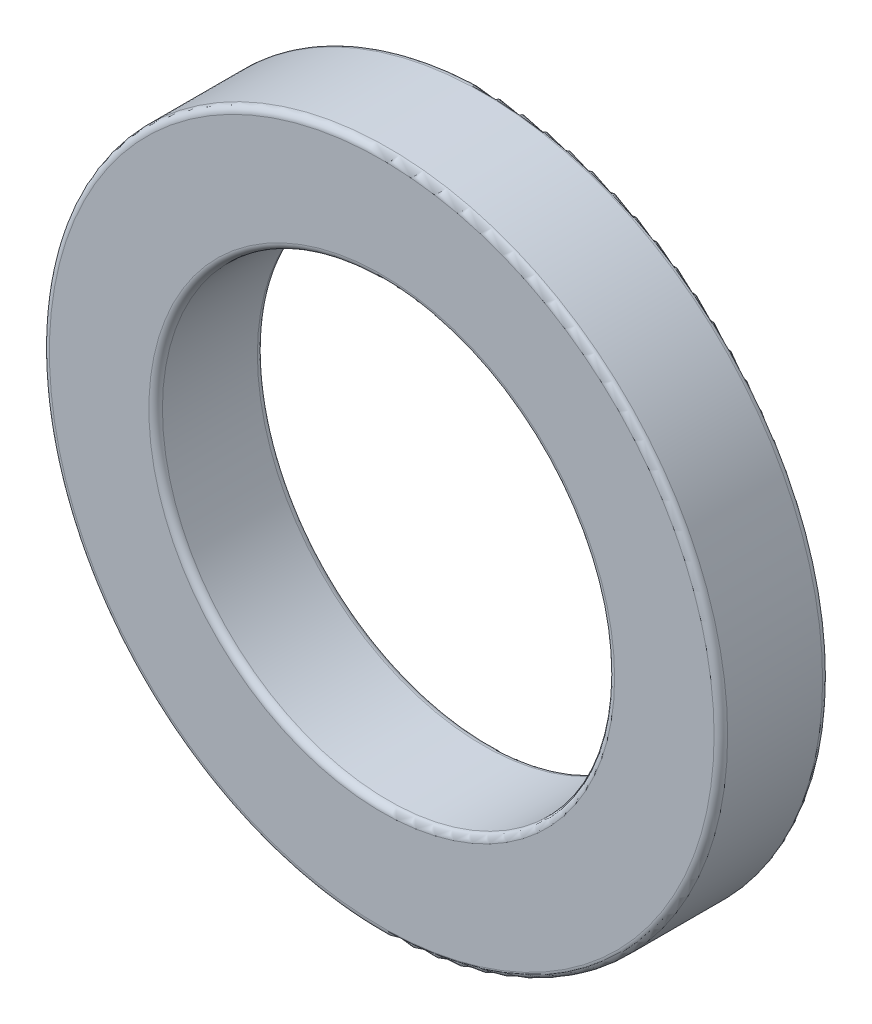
ISO-10303-21;
HEADER;
FILE_DESCRIPTION(('STEP AP214'),'2;1');
FILE_NAME('part.step','',(''),(''),'','','');
FILE_SCHEMA(('AUTOMOTIVE_DESIGN { 1 0 10303 214 1 1 1 1 }'));
ENDSEC;
DATA;
#1=APPLICATION_CONTEXT('core data for automotive mechanical design processes');
#2=APPLICATION_PROTOCOL_DEFINITION('international standard','automotive_design',2000,#1);
#3=PRODUCT_CONTEXT('',#1,'mechanical');
#4=PRODUCT('Part','Part','',(#3));
#5=PRODUCT_RELATED_PRODUCT_CATEGORY('part','',(#4));
#6=PRODUCT_DEFINITION_FORMATION('','',#4);
#7=PRODUCT_DEFINITION_CONTEXT('part definition',#1,'design');
#8=PRODUCT_DEFINITION('design','',#6,#7);
#9=PRODUCT_DEFINITION_SHAPE('','',#8);
#10=(LENGTH_UNIT() NAMED_UNIT(*) SI_UNIT(.MILLI.,.METRE.));
#11=(NAMED_UNIT(*) PLANE_ANGLE_UNIT() SI_UNIT($,.RADIAN.));
#12=(NAMED_UNIT(*) SI_UNIT($,.STERADIAN.) SOLID_ANGLE_UNIT());
#13=UNCERTAINTY_MEASURE_WITH_UNIT(LENGTH_MEASURE(1.E-05),#10,'distance_accuracy_value','');
#14=(GEOMETRIC_REPRESENTATION_CONTEXT(3) GLOBAL_UNCERTAINTY_ASSIGNED_CONTEXT((#13)) GLOBAL_UNIT_ASSIGNED_CONTEXT((#10,
#11,#12)) REPRESENTATION_CONTEXT('',''));
#15=CARTESIAN_POINT('',(0.,0.,0.));
#16=DIRECTION('',(0.,0.,1.));
#17=DIRECTION('',(1.,0.,0.));
#18=AXIS2_PLACEMENT_3D('',#15,#16,#17);
#19=CARTESIAN_POINT('',(0.,0.,-1.5));
#20=DIRECTION('',(0.,0.,1.));
#21=DIRECTION('',(1.,0.,0.));
#22=AXIS2_PLACEMENT_3D('',#19,#20,#21);
#23=TOROIDAL_SURFACE('',#22,73.5,1.5);
#24=CARTESIAN_POINT('',(0.,0.,-1.5));
#25=DIRECTION('',(0.,0.,1.));
#26=DIRECTION('',(1.,0.,0.));
#27=AXIS2_PLACEMENT_3D('',#24,#25,#26);
#28=CIRCLE('',#27,75.);
#29=CARTESIAN_POINT('',(75.0000000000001,0.,-1.5));
#30=VERTEX_POINT('',#29);
#31=EDGE_CURVE('E10',#30,#30,#28,.T.);
#32=ORIENTED_EDGE('',*,*,#31,.T.);
#33=EDGE_LOOP('',(#32));
#34=FACE_BOUND('',#33,.T.);
#35=CARTESIAN_POINT('',(0.,0.,0.));
#36=DIRECTION('',(0.,0.,1.));
#37=DIRECTION('',(1.,0.,0.));
#38=AXIS2_PLACEMENT_3D('',#35,#36,#37);
#39=CIRCLE('',#38,73.5);
#40=CARTESIAN_POINT('',(73.5000000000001,0.,0.));
#41=VERTEX_POINT('',#40);
#42=EDGE_CURVE('E59',#41,#41,#39,.T.);
#43=ORIENTED_EDGE('',*,*,#42,.F.);
#44=EDGE_LOOP('',(#43));
#45=FACE_BOUND('',#44,.T.);
#46=ADVANCED_FACE('F31',(#34,#45),#23,.T.);
#47=CARTESIAN_POINT('',(0.,0.,33.1757165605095));
#48=DIRECTION('',(0.,0.,1.));
#49=DIRECTION('',(1.,0.,0.));
#50=AXIS2_PLACEMENT_3D('',#47,#48,#49);
#51=CYLINDRICAL_SURFACE('',#50,75.);
#52=CARTESIAN_POINT('',(0.,0.,-22.5));
#53=DIRECTION('',(0.,0.,1.));
#54=DIRECTION('',(1.,0.,0.));
#55=AXIS2_PLACEMENT_3D('',#52,#53,#54);
#56=CIRCLE('',#55,75.);
#57=CARTESIAN_POINT('',(75.0000000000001,0.,-22.5));
#58=VERTEX_POINT('',#57);
#59=EDGE_CURVE('E37',#58,#58,#56,.T.);
#60=ORIENTED_EDGE('',*,*,#59,.T.);
#61=EDGE_LOOP('',(#60));
#62=FACE_BOUND('',#61,.T.);
#63=ORIENTED_EDGE('',*,*,#31,.F.);
#64=EDGE_LOOP('',(#63));
#65=FACE_BOUND('',#64,.T.);
#66=ADVANCED_FACE('F161',(#62,#65),#51,.T.);
#67=CARTESIAN_POINT('',(0.,0.,-22.5));
#68=DIRECTION('',(0.,0.,1.));
#69=DIRECTION('',(1.,0.,0.));
#70=AXIS2_PLACEMENT_3D('',#67,#68,#69);
#71=TOROIDAL_SURFACE('',#70,73.5,1.49999999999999);
#72=ORIENTED_EDGE('',*,*,#59,.F.);
#73=EDGE_LOOP('',(#72));
#74=FACE_BOUND('',#73,.T.);
#75=CARTESIAN_POINT('',(0.,0.,-24.));
#76=DIRECTION('',(0.,0.,1.));
#77=DIRECTION('',(1.,0.,0.));
#78=AXIS2_PLACEMENT_3D('',#75,#76,#77);
#79=CIRCLE('',#78,73.5);
#80=CARTESIAN_POINT('',(73.5000000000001,0.,-24.));
#81=VERTEX_POINT('',#80);
#82=EDGE_CURVE('E41',#81,#81,#79,.T.);
#83=ORIENTED_EDGE('',*,*,#82,.T.);
#84=EDGE_LOOP('',(#83));
#85=FACE_BOUND('',#84,.T.);
#86=ADVANCED_FACE('F158',(#74,#85),#71,.T.);
#87=CARTESIAN_POINT('',(0.,73.5000000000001,-24.));
#88=DIRECTION('',(0.,0.,-1.));
#89=DIRECTION('',(-1.,0.,0.));
#90=AXIS2_PLACEMENT_3D('',#87,#88,#89);
#91=PLANE('',#90);
#92=CARTESIAN_POINT('',(0.,0.,-24.));
#93=DIRECTION('',(0.,0.,1.));
#94=DIRECTION('',(1.,0.,0.));
#95=AXIS2_PLACEMENT_3D('',#92,#93,#94);
#96=CIRCLE('',#95,51.5);
#97=CARTESIAN_POINT('',(51.5000000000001,0.,-24.));
#98=VERTEX_POINT('',#97);
#99=EDGE_CURVE('E45',#98,#98,#96,.T.);
#100=ORIENTED_EDGE('',*,*,#99,.T.);
#101=EDGE_LOOP('',(#100));
#102=FACE_BOUND('',#101,.T.);
#103=ORIENTED_EDGE('',*,*,#82,.F.);
#104=EDGE_LOOP('',(#103));
#105=FACE_BOUND('',#104,.T.);
#106=ADVANCED_FACE('F154',(#102,#105),#91,.T.);
#107=CARTESIAN_POINT('',(0.,0.,-22.5));
#108=DIRECTION('',(0.,0.,1.));
#109=DIRECTION('',(1.,0.,0.));
#110=AXIS2_PLACEMENT_3D('',#107,#108,#109);
#111=TOROIDAL_SURFACE('',#110,51.5,1.5);
#112=CARTESIAN_POINT('',(0.,0.,-22.5));
#113=DIRECTION('',(0.,0.,1.));
#114=DIRECTION('',(1.,0.,0.));
#115=AXIS2_PLACEMENT_3D('',#112,#113,#114);
#116=CIRCLE('',#115,50.);
#117=CARTESIAN_POINT('',(50.0000000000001,0.,-22.5));
#118=VERTEX_POINT('',#117);
#119=EDGE_CURVE('E50',#118,#118,#116,.T.);
#120=ORIENTED_EDGE('',*,*,#119,.T.);
#121=EDGE_LOOP('',(#120));
#122=FACE_BOUND('',#121,.T.);
#123=ORIENTED_EDGE('',*,*,#99,.F.);
#124=EDGE_LOOP('',(#123));
#125=FACE_BOUND('',#124,.T.);
#126=ADVANCED_FACE('F150',(#122,#125),#111,.T.);
#127=CARTESIAN_POINT('',(0.,0.,33.1757165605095));
#128=DIRECTION('',(0.,0.,1.));
#129=DIRECTION('',(1.,0.,0.));
#130=AXIS2_PLACEMENT_3D('',#127,#128,#129);
#131=CYLINDRICAL_SURFACE('',#130,50.);
#132=CARTESIAN_POINT('',(0.,0.,-1.5));
#133=DIRECTION('',(0.,0.,1.));
#134=DIRECTION('',(1.,0.,0.));
#135=AXIS2_PLACEMENT_3D('',#132,#133,#134);
#136=CIRCLE('',#135,50.);
#137=CARTESIAN_POINT('',(50.0000000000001,0.,-1.5));
#138=VERTEX_POINT('',#137);
#139=EDGE_CURVE('E53',#138,#138,#136,.T.);
#140=ORIENTED_EDGE('',*,*,#139,.T.);
#141=EDGE_LOOP('',(#140));
#142=FACE_BOUND('',#141,.T.);
#143=ORIENTED_EDGE('',*,*,#119,.F.);
#144=EDGE_LOOP('',(#143));
#145=FACE_BOUND('',#144,.T.);
#146=ADVANCED_FACE('F146',(#142,#145),#131,.F.);
#147=CARTESIAN_POINT('',(0.,0.,-1.5));
#148=DIRECTION('',(0.,0.,1.));
#149=DIRECTION('',(1.,0.,0.));
#150=AXIS2_PLACEMENT_3D('',#147,#148,#149);
#151=TOROIDAL_SURFACE('',#150,51.5,1.5);
#152=CARTESIAN_POINT('',(0.,0.,0.));
#153=DIRECTION('',(0.,0.,1.));
#154=DIRECTION('',(1.,0.,0.));
#155=AXIS2_PLACEMENT_3D('',#152,#153,#154);
#156=CIRCLE('',#155,51.5);
#157=CARTESIAN_POINT('',(51.5000000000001,0.,0.));
#158=VERTEX_POINT('',#157);
#159=EDGE_CURVE('E56',#158,#158,#156,.T.);
#160=ORIENTED_EDGE('',*,*,#159,.T.);
#161=EDGE_LOOP('',(#160));
#162=FACE_BOUND('',#161,.T.);
#163=ORIENTED_EDGE('',*,*,#139,.F.);
#164=EDGE_LOOP('',(#163));
#165=FACE_BOUND('',#164,.T.);
#166=ADVANCED_FACE('F142',(#162,#165),#151,.T.);
#167=CARTESIAN_POINT('',(0.,51.5000000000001,0.));
#168=DIRECTION('',(0.,0.,1.));
#169=DIRECTION('',(1.,0.,0.));
#170=AXIS2_PLACEMENT_3D('',#167,#168,#169);
#171=PLANE('',#170);
#172=ORIENTED_EDGE('',*,*,#42,.T.);
#173=EDGE_LOOP('',(#172));
#174=FACE_BOUND('',#173,.T.);
#175=ORIENTED_EDGE('',*,*,#159,.F.);
#176=EDGE_LOOP('',(#175));
#177=FACE_BOUND('',#176,.T.);
#178=ADVANCED_FACE('F140',(#174,#177),#171,.T.);
#179=CLOSED_SHELL('',(#46,#66,#86,#106,#126,#146,#166,#178));
#180=CARTESIAN_POINT('',(0.,68.7500000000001,-11.985));
#181=DIRECTION('',(0.,0.,1.));
#182=DIRECTION('',(1.,0.,0.));
#183=AXIS2_PLACEMENT_3D('',#180,#181,#182);
#184=PLANE('',#183);
#185=CARTESIAN_POINT('',(0.,0.,-11.985));
#186=DIRECTION('',(0.,0.,1.));
#187=DIRECTION('',(1.,0.,0.));
#188=AXIS2_PLACEMENT_3D('',#185,#186,#187);
#189=CIRCLE('',#188,68.76);
#190=CARTESIAN_POINT('',(68.7600000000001,0.,-11.985));
#191=VERTEX_POINT('',#190);
#192=EDGE_CURVE('E62',#191,#191,#189,.T.);
#193=ORIENTED_EDGE('',*,*,#192,.F.);
#194=EDGE_LOOP('',(#193));
#195=FACE_BOUND('',#194,.T.);
#196=CARTESIAN_POINT('',(0.,0.,-11.985));
#197=DIRECTION('',(0.,0.,1.));
#198=DIRECTION('',(1.,0.,0.));
#199=AXIS2_PLACEMENT_3D('',#196,#197,#198);
#200=CIRCLE('',#199,62.515);
#201=CARTESIAN_POINT('',(62.5150000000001,0.,-11.985));
#202=VERTEX_POINT('',#201);
#203=EDGE_CURVE('E95',#202,#202,#200,.T.);
#204=ORIENTED_EDGE('',*,*,#203,.T.);
#205=EDGE_LOOP('',(#204));
#206=FACE_BOUND('',#205,.T.);
#207=ADVANCED_FACE('F99',(#195,#206),#184,.F.);
#208=CARTESIAN_POINT('',(0.,0.,8.31184503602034));
#209=DIRECTION('',(0.,0.,1.));
#210=DIRECTION('',(1.,0.,0.));
#211=AXIS2_PLACEMENT_3D('',#208,#209,#210);
#212=CYLINDRICAL_SURFACE('',#211,68.76);
#213=CARTESIAN_POINT('',(0.,0.,-12.015));
#214=DIRECTION('',(0.,0.,1.));
#215=DIRECTION('',(1.,0.,0.));
#216=AXIS2_PLACEMENT_3D('',#213,#214,#215);
#217=CIRCLE('',#216,68.76);
#218=CARTESIAN_POINT('',(68.7600000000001,0.,-12.015));
#219=VERTEX_POINT('',#218);
#220=EDGE_CURVE('E65',#219,#219,#217,.T.);
#221=ORIENTED_EDGE('',*,*,#220,.F.);
#222=EDGE_LOOP('',(#221));
#223=FACE_BOUND('',#222,.T.);
#224=ORIENTED_EDGE('',*,*,#192,.T.);
#225=EDGE_LOOP('',(#224));
#226=FACE_BOUND('',#225,.T.);
#227=ADVANCED_FACE('F127',(#223,#226),#212,.F.);
#228=CARTESIAN_POINT('',(0.,68.7500000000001,-12.015));
#229=DIRECTION('',(0.,0.,1.));
#230=DIRECTION('',(1.,0.,0.));
#231=AXIS2_PLACEMENT_3D('',#228,#229,#230);
#232=PLANE('',#231);
#233=ORIENTED_EDGE('',*,*,#220,.T.);
#234=EDGE_LOOP('',(#233));
#235=FACE_BOUND('',#234,.T.);
#236=CARTESIAN_POINT('',(0.,0.,-12.015));
#237=DIRECTION('',(0.,0.,1.));
#238=DIRECTION('',(1.,0.,0.));
#239=AXIS2_PLACEMENT_3D('',#236,#237,#238);
#240=CIRCLE('',#239,62.515);
#241=CARTESIAN_POINT('',(62.5150000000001,0.,-12.015));
#242=VERTEX_POINT('',#241);
#243=EDGE_CURVE('E68',#242,#242,#240,.T.);
#244=ORIENTED_EDGE('',*,*,#243,.F.);
#245=EDGE_LOOP('',(#244));
#246=FACE_BOUND('',#245,.T.);
#247=ADVANCED_FACE('F134',(#235,#246),#232,.T.);
#248=CARTESIAN_POINT('',(0.,0.,8.31184503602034));
#249=DIRECTION('',(0.,0.,1.));
#250=DIRECTION('',(1.,0.,0.));
#251=AXIS2_PLACEMENT_3D('',#248,#249,#250);
#252=CYLINDRICAL_SURFACE('',#251,62.515);
#253=ORIENTED_EDGE('',*,*,#243,.T.);
#254=EDGE_LOOP('',(#253));
#255=FACE_BOUND('',#254,.T.);
#256=CARTESIAN_POINT('',(0.,0.,-21.61));
#257=DIRECTION('',(0.,0.,1.));
#258=DIRECTION('',(1.,0.,0.));
#259=AXIS2_PLACEMENT_3D('',#256,#257,#258);
#260=CIRCLE('',#259,62.515);
#261=CARTESIAN_POINT('',(62.5150000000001,0.,-21.61));
#262=VERTEX_POINT('',#261);
#263=EDGE_CURVE('E71',#262,#262,#260,.T.);
#264=ORIENTED_EDGE('',*,*,#263,.F.);
#265=EDGE_LOOP('',(#264));
#266=FACE_BOUND('',#265,.T.);
#267=ADVANCED_FACE('F242',(#255,#266),#252,.F.);
#268=CARTESIAN_POINT('',(0.,68.7500000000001,-21.61));
#269=DIRECTION('',(0.,0.,1.));
#270=DIRECTION('',(1.,0.,0.));
#271=AXIS2_PLACEMENT_3D('',#268,#269,#270);
#272=PLANE('',#271);
#273=ORIENTED_EDGE('',*,*,#263,.T.);
#274=EDGE_LOOP('',(#273));
#275=FACE_BOUND('',#274,.T.);
#276=CARTESIAN_POINT('',(0.,0.,-21.61));
#277=DIRECTION('',(0.,0.,1.));
#278=DIRECTION('',(1.,0.,0.));
#279=AXIS2_PLACEMENT_3D('',#276,#277,#278);
#280=CIRCLE('',#279,62.485);
#281=CARTESIAN_POINT('',(62.4850000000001,0.,-21.61));
#282=VERTEX_POINT('',#281);
#283=EDGE_CURVE('E74',#282,#282,#280,.T.);
#284=ORIENTED_EDGE('',*,*,#283,.F.);
#285=EDGE_LOOP('',(#284));
#286=FACE_BOUND('',#285,.T.);
#287=ADVANCED_FACE('F251',(#275,#286),#272,.T.);
#288=CARTESIAN_POINT('',(0.,0.,8.31184503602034));
#289=DIRECTION('',(0.,0.,1.));
#290=DIRECTION('',(1.,0.,0.));
#291=AXIS2_PLACEMENT_3D('',#288,#289,#290);
#292=CYLINDRICAL_SURFACE('',#291,62.485);
#293=CARTESIAN_POINT('',(0.,0.,-12.015));
#294=DIRECTION('',(0.,0.,1.));
#295=DIRECTION('',(1.,0.,0.));
#296=AXIS2_PLACEMENT_3D('',#293,#294,#295);
#297=CIRCLE('',#296,62.485);
#298=CARTESIAN_POINT('',(62.4850000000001,0.,-12.015));
#299=VERTEX_POINT('',#298);
#300=EDGE_CURVE('E77',#299,#299,#297,.T.);
#301=ORIENTED_EDGE('',*,*,#300,.F.);
#302=EDGE_LOOP('',(#301));
#303=FACE_BOUND('',#302,.T.);
#304=ORIENTED_EDGE('',*,*,#283,.T.);
#305=EDGE_LOOP('',(#304));
#306=FACE_BOUND('',#305,.T.);
#307=ADVANCED_FACE('F261',(#303,#306),#292,.T.);
#308=CARTESIAN_POINT('',(0.,68.7500000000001,-12.015));
#309=DIRECTION('',(0.,0.,-1.));
#310=DIRECTION('',(-1.,0.,0.));
#311=AXIS2_PLACEMENT_3D('',#308,#309,#310);
#312=PLANE('',#311);
#313=CARTESIAN_POINT('',(0.,0.,-12.015));
#314=DIRECTION('',(0.,0.,1.));
#315=DIRECTION('',(1.,0.,0.));
#316=AXIS2_PLACEMENT_3D('',#313,#314,#315);
#317=CIRCLE('',#316,56.24);
#318=CARTESIAN_POINT('',(56.2400000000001,0.,-12.015));
#319=VERTEX_POINT('',#318);
#320=EDGE_CURVE('E80',#319,#319,#317,.T.);
#321=ORIENTED_EDGE('',*,*,#320,.F.);
#322=EDGE_LOOP('',(#321));
#323=FACE_BOUND('',#322,.T.);
#324=ORIENTED_EDGE('',*,*,#300,.T.);
#325=EDGE_LOOP('',(#324));
#326=FACE_BOUND('',#325,.T.);
#327=ADVANCED_FACE('F271',(#323,#326),#312,.F.);
#328=CARTESIAN_POINT('',(0.,0.,8.31184503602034));
#329=DIRECTION('',(0.,0.,1.));
#330=DIRECTION('',(1.,0.,0.));
#331=AXIS2_PLACEMENT_3D('',#328,#329,#330);
#332=CYLINDRICAL_SURFACE('',#331,56.24);
#333=ORIENTED_EDGE('',*,*,#320,.T.);
#334=EDGE_LOOP('',(#333));
#335=FACE_BOUND('',#334,.T.);
#336=CARTESIAN_POINT('',(0.,0.,-11.985));
#337=DIRECTION('',(0.,0.,1.));
#338=DIRECTION('',(1.,0.,0.));
#339=AXIS2_PLACEMENT_3D('',#336,#337,#338);
#340=CIRCLE('',#339,56.24);
#341=CARTESIAN_POINT('',(56.2400000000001,0.,-11.985));
#342=VERTEX_POINT('',#341);
#343=EDGE_CURVE('E83',#342,#342,#340,.T.);
#344=ORIENTED_EDGE('',*,*,#343,.F.);
#345=EDGE_LOOP('',(#344));
#346=FACE_BOUND('',#345,.T.);
#347=ADVANCED_FACE('F122',(#335,#346),#332,.T.);
#348=CARTESIAN_POINT('',(0.,68.7500000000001,-11.985));
#349=DIRECTION('',(0.,0.,-1.));
#350=DIRECTION('',(-1.,0.,0.));
#351=AXIS2_PLACEMENT_3D('',#348,#349,#350);
#352=PLANE('',#351);
#353=ORIENTED_EDGE('',*,*,#343,.T.);
#354=EDGE_LOOP('',(#353));
#355=FACE_BOUND('',#354,.T.);
#356=CARTESIAN_POINT('',(0.,0.,-11.985));
#357=DIRECTION('',(0.,0.,1.));
#358=DIRECTION('',(1.,0.,0.));
#359=AXIS2_PLACEMENT_3D('',#356,#357,#358);
#360=CIRCLE('',#359,62.485);
#361=CARTESIAN_POINT('',(62.4850000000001,0.,-11.985));
#362=VERTEX_POINT('',#361);
#363=EDGE_CURVE('E86',#362,#362,#360,.T.);
#364=ORIENTED_EDGE('',*,*,#363,.F.);
#365=EDGE_LOOP('',(#364));
#366=FACE_BOUND('',#365,.T.);
#367=ADVANCED_FACE('F116',(#355,#366),#352,.T.);
#368=CARTESIAN_POINT('',(0.,0.,8.31184503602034));
#369=DIRECTION('',(0.,0.,1.));
#370=DIRECTION('',(1.,0.,0.));
#371=AXIS2_PLACEMENT_3D('',#368,#369,#370);
#372=CYLINDRICAL_SURFACE('',#371,62.485);
#373=ORIENTED_EDGE('',*,*,#363,.T.);
#374=EDGE_LOOP('',(#373));
#375=FACE_BOUND('',#374,.T.);
#376=CARTESIAN_POINT('',(0.,0.,-2.39));
#377=DIRECTION('',(0.,0.,1.));
#378=DIRECTION('',(1.,0.,0.));
#379=AXIS2_PLACEMENT_3D('',#376,#377,#378);
#380=CIRCLE('',#379,62.485);
#381=CARTESIAN_POINT('',(62.4850000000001,0.,-2.39));
#382=VERTEX_POINT('',#381);
#383=EDGE_CURVE('E89',#382,#382,#380,.T.);
#384=ORIENTED_EDGE('',*,*,#383,.F.);
#385=EDGE_LOOP('',(#384));
#386=FACE_BOUND('',#385,.T.);
#387=ADVANCED_FACE('F111',(#375,#386),#372,.T.);
#388=CARTESIAN_POINT('',(0.,68.7500000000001,-2.39));
#389=DIRECTION('',(0.,0.,1.));
#390=DIRECTION('',(1.,0.,0.));
#391=AXIS2_PLACEMENT_3D('',#388,#389,#390);
#392=PLANE('',#391);
#393=CARTESIAN_POINT('',(0.,0.,-2.39));
#394=DIRECTION('',(0.,0.,1.));
#395=DIRECTION('',(1.,0.,0.));
#396=AXIS2_PLACEMENT_3D('',#393,#394,#395);
#397=CIRCLE('',#396,62.515);
#398=CARTESIAN_POINT('',(62.5150000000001,0.,-2.39));
#399=VERTEX_POINT('',#398);
#400=EDGE_CURVE('E92',#399,#399,#397,.T.);
#401=ORIENTED_EDGE('',*,*,#400,.F.);
#402=EDGE_LOOP('',(#401));
#403=FACE_BOUND('',#402,.T.);
#404=ORIENTED_EDGE('',*,*,#383,.T.);
#405=EDGE_LOOP('',(#404));
#406=FACE_BOUND('',#405,.T.);
#407=ADVANCED_FACE('F104',(#403,#406),#392,.F.);
#408=CARTESIAN_POINT('',(0.,0.,8.31184503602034));
#409=DIRECTION('',(0.,0.,1.));
#410=DIRECTION('',(1.,0.,0.));
#411=AXIS2_PLACEMENT_3D('',#408,#409,#410);
#412=CYLINDRICAL_SURFACE('',#411,62.515);
#413=ORIENTED_EDGE('',*,*,#203,.F.);
#414=EDGE_LOOP('',(#413));
#415=FACE_BOUND('',#414,.T.);
#416=ORIENTED_EDGE('',*,*,#400,.T.);
#417=EDGE_LOOP('',(#416));
#418=FACE_BOUND('',#417,.T.);
#419=ADVANCED_FACE('F101',(#415,#418),#412,.F.);
#420=CLOSED_SHELL('',(#207,#227,#247,#267,#287,#307,#327,#347,#367,#387,#407,#419));
#421=ORIENTED_CLOSED_SHELL('',*,#420,.T.);
#422=BREP_WITH_VOIDS('B2',#179,(#421));
#423=ADVANCED_BREP_SHAPE_REPRESENTATION('',(#18,#422),#14);
#424=SHAPE_DEFINITION_REPRESENTATION(#9,#423);
ENDSEC;
END-ISO-10303-21;
